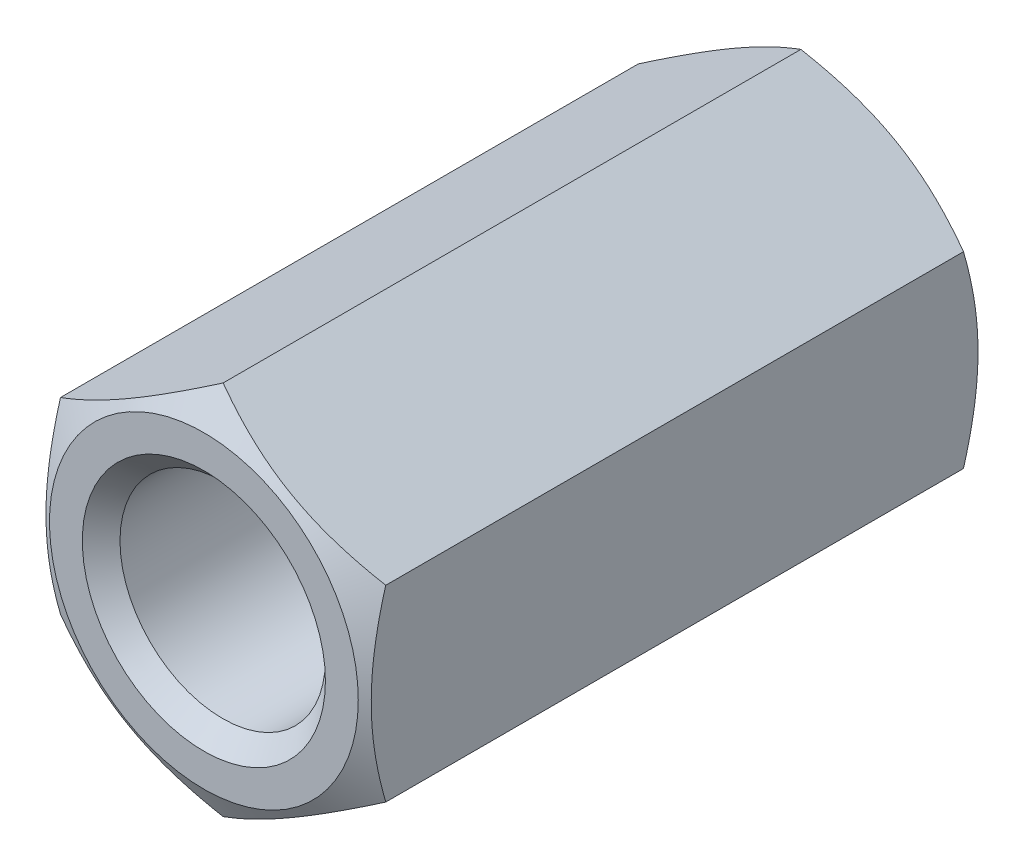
ISO-10303-21;
HEADER;
FILE_DESCRIPTION(('STEP AP214'),'2;1');
FILE_NAME('part.step','',(''),(''),'','','');
FILE_SCHEMA(('AUTOMOTIVE_DESIGN { 1 0 10303 214 1 1 1 1 }'));
ENDSEC;
DATA;
#1=APPLICATION_CONTEXT('core data for automotive mechanical design processes');
#2=APPLICATION_PROTOCOL_DEFINITION('international standard','automotive_design',2000,#1);
#3=PRODUCT_CONTEXT('',#1,'mechanical');
#4=PRODUCT('Part','Part','',(#3));
#5=PRODUCT_RELATED_PRODUCT_CATEGORY('part','',(#4));
#6=PRODUCT_DEFINITION_FORMATION('','',#4);
#7=PRODUCT_DEFINITION_CONTEXT('part definition',#1,'design');
#8=PRODUCT_DEFINITION('design','',#6,#7);
#9=PRODUCT_DEFINITION_SHAPE('','',#8);
#10=(LENGTH_UNIT() NAMED_UNIT(*) SI_UNIT(.MILLI.,.METRE.));
#11=(NAMED_UNIT(*) PLANE_ANGLE_UNIT() SI_UNIT($,.RADIAN.));
#12=(NAMED_UNIT(*) SI_UNIT($,.STERADIAN.) SOLID_ANGLE_UNIT());
#13=UNCERTAINTY_MEASURE_WITH_UNIT(LENGTH_MEASURE(1.E-05),#10,'distance_accuracy_value','');
#14=(GEOMETRIC_REPRESENTATION_CONTEXT(3) GLOBAL_UNCERTAINTY_ASSIGNED_CONTEXT((#13)) GLOBAL_UNIT_ASSIGNED_CONTEXT((#10,
#11,#12)) REPRESENTATION_CONTEXT('',''));
#15=CARTESIAN_POINT('',(0.,0.,0.));
#16=DIRECTION('',(0.,0.,1.));
#17=DIRECTION('',(1.,0.,0.));
#18=AXIS2_PLACEMENT_3D('',#15,#16,#17);
#19=CARTESIAN_POINT('',(9.5,5.48482755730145,36.));
#20=DIRECTION('',(-0.5,-0.866025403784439,0.));
#21=DIRECTION('',(0.866025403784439,-0.5,0.));
#22=AXIS2_PLACEMENT_3D('',#19,#20,#21);
#23=PLANE('',#22);
#24=CARTESIAN_POINT('',(-0.00020000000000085,10.9697705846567,1.12589969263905));
#25=CARTESIAN_POINT('',(0.208630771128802,10.8492020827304,1.05630068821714));
#26=CARTESIAN_POINT('',(0.418240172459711,10.7281840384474,0.989860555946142));
#27=CARTESIAN_POINT('',(0.839139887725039,10.4851774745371,0.864174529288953));
#28=CARTESIAN_POINT('',(1.05043073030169,10.3631886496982,0.804931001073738));
#29=CARTESIAN_POINT('',(1.68770779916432,9.99525656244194,0.639141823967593));
#30=CARTESIAN_POINT('',(2.11620976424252,9.74786083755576,0.544841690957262));
#31=CARTESIAN_POINT('',(2.75744333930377,9.37764446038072,0.434265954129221));
#32=CARTESIAN_POINT('',(2.96825921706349,9.2559298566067,0.402767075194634));
#33=CARTESIAN_POINT('',(3.39086703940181,9.01193711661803,0.349945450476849));
#34=CARTESIAN_POINT('',(3.60265900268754,8.88965896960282,0.328622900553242));
#35=CARTESIAN_POINT('',(4.02659621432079,8.64489870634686,0.296700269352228));
#36=CARTESIAN_POINT('',(4.23874074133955,8.52241700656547,0.286087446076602));
#37=CARTESIAN_POINT('',(4.66322575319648,8.27734047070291,0.275809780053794));
#38=CARTESIAN_POINT('',(4.87556623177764,8.15474563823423,0.276144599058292));
#39=CARTESIAN_POINT('',(5.27254199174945,7.92555157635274,0.287000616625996));
#40=CARTESIAN_POINT('',(5.45720529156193,7.81893617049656,0.296197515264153));
#41=CARTESIAN_POINT('',(5.82610000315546,7.60595470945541,0.322692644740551));
#42=CARTESIAN_POINT('',(6.01033138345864,7.49958867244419,0.33999144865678));
#43=CARTESIAN_POINT('',(6.562311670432,7.18090270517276,0.40363173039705));
#44=CARTESIAN_POINT('',(6.92908353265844,6.96914687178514,0.461709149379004));
#45=CARTESIAN_POINT('',(7.66651782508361,6.54338898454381,0.606903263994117));
#46=CARTESIAN_POINT('',(8.03708614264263,6.32944126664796,0.694635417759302));
#47=CARTESIAN_POINT('',(8.77269671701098,5.90473630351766,0.89375098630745));
#48=CARTESIAN_POINT('',(9.137748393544,5.69397361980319,1.00508763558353));
#49=CARTESIAN_POINT('',(9.5002,5.48471208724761,1.12589969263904));
#50=B_SPLINE_CURVE_WITH_KNOTS('',3,(#24,#25,#26,#27,#28,#29,#30,#31,#32,#33,#34,#35,#36,#37,#38,
#39,#40,#41,#42,#43,#44,#45,#46,#47,#48,#49),.UNSPECIFIED.,.F.,.F.,(4,2,2,2,2,2,2,2,2,2,2,2,4),
(0.,0.752880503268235,1.50600787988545,3.01546870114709,3.75167336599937,4.48789219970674,
5.22323407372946,5.95855322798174,6.5986808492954,7.23885375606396,8.52010929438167,
9.82978009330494,11.1368800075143),.UNSPECIFIED.);
#51=CARTESIAN_POINT('',(0.,10.9696551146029,1.12583302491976));
#52=VERTEX_POINT('',#51);
#53=CARTESIAN_POINT('',(9.5,5.48482755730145,1.12583302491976));
#54=VERTEX_POINT('',#53);
#55=EDGE_CURVE('E30',#52,#54,#50,.T.);
#56=ORIENTED_EDGE('',*,*,#55,.F.);
#57=DIRECTION('',(0.,0.,-1.));
#58=VECTOR('',#57,1.);
#59=CARTESIAN_POINT('',(0.,10.9696551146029,36.));
#60=LINE('',#59,#58);
#61=CARTESIAN_POINT('',(0.,10.9696551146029,34.8741669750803));
#62=VERTEX_POINT('',#61);
#63=EDGE_CURVE('E9',#62,#52,#60,.T.);
#64=ORIENTED_EDGE('',*,*,#63,.F.);
#65=CARTESIAN_POINT('',(9.5002,5.48471208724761,34.874100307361));
#66=CARTESIAN_POINT('',(9.2913692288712,5.6052805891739,34.9436993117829));
#67=CARTESIAN_POINT('',(9.0817598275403,5.72629863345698,35.0101394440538));
#68=CARTESIAN_POINT('',(8.66086011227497,5.96930519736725,35.135825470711));
#69=CARTESIAN_POINT('',(8.44956926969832,6.09129402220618,35.1950689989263));
#70=CARTESIAN_POINT('',(7.81229220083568,6.4592261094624,35.3608581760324));
#71=CARTESIAN_POINT('',(7.38379023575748,6.70662183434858,35.4551583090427));
#72=CARTESIAN_POINT('',(6.74255666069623,7.07683821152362,35.5657340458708));
#73=CARTESIAN_POINT('',(6.53174078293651,7.19855281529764,35.5972329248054));
#74=CARTESIAN_POINT('',(6.10913296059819,7.44254555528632,35.6500545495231));
#75=CARTESIAN_POINT('',(5.89734099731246,7.56482370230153,35.6713770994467));
#76=CARTESIAN_POINT('',(5.47340378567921,7.80958396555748,35.7032997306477));
#77=CARTESIAN_POINT('',(5.26125925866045,7.93206566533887,35.7139125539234));
#78=CARTESIAN_POINT('',(4.83677424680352,8.17714220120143,35.7241902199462));
#79=CARTESIAN_POINT('',(4.62443376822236,8.29973703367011,35.7238554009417));
#80=CARTESIAN_POINT('',(4.22745800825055,8.5289310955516,35.712999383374));
#81=CARTESIAN_POINT('',(4.04279470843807,8.63554650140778,35.7038024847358));
#82=CARTESIAN_POINT('',(3.67389999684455,8.84852796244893,35.6773073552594));
#83=CARTESIAN_POINT('',(3.48966861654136,8.95489399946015,35.6600085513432));
#84=CARTESIAN_POINT('',(2.937688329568,9.27357996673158,35.596368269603));
#85=CARTESIAN_POINT('',(2.57091646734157,9.48533580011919,35.538290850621));
#86=CARTESIAN_POINT('',(1.83348217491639,9.91109368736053,35.3930967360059));
#87=CARTESIAN_POINT('',(1.46291385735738,10.1250414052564,35.3053645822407));
#88=CARTESIAN_POINT('',(0.727303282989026,10.5497463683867,35.1062490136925));
#89=CARTESIAN_POINT('',(0.362251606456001,10.7605090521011,34.9949123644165));
#90=CARTESIAN_POINT('',(-0.000200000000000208,10.9697705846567,34.874100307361));
#91=B_SPLINE_CURVE_WITH_KNOTS('',3,(#65,#66,#67,#68,#69,#70,#71,#72,#73,#74,#75,#76,#77,#78,#79,
#80,#81,#82,#83,#84,#85,#86,#87,#88,#89,#90),.UNSPECIFIED.,.F.,.F.,(4,2,2,2,2,2,2,2,2,2,2,2,4),
(0.,0.752880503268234,1.50600787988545,3.0154687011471,3.75167336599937,4.48789219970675,
5.22323407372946,5.95855322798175,6.5986808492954,7.23885375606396,8.52010929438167,
9.82978009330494,11.1368800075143),.UNSPECIFIED.);
#92=CARTESIAN_POINT('',(9.5,5.48482755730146,34.8741669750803));
#93=VERTEX_POINT('',#92);
#94=EDGE_CURVE('E86',#93,#62,#91,.T.);
#95=ORIENTED_EDGE('',*,*,#94,.F.);
#96=DIRECTION('',(0.,0.,-1.));
#97=VECTOR('',#96,1.);
#98=CARTESIAN_POINT('',(9.5,5.48482755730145,36.));
#99=LINE('',#98,#97);
#100=EDGE_CURVE('E79',#93,#54,#99,.T.);
#101=ORIENTED_EDGE('',*,*,#100,.T.);
#102=EDGE_LOOP('',(#56,#64,#95,#101));
#103=FACE_BOUND('',#102,.T.);
#104=ADVANCED_FACE('F14',(#103),#23,.F.);
#105=CARTESIAN_POINT('',(0.,10.9696551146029,36.));
#106=DIRECTION('',(0.5,-0.866025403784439,0.));
#107=DIRECTION('',(0.866025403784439,0.5,0.));
#108=AXIS2_PLACEMENT_3D('',#105,#106,#107);
#109=PLANE('',#108);
#110=CARTESIAN_POINT('',(-9.5002,5.48471208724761,1.12589969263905));
#111=CARTESIAN_POINT('',(-9.2913692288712,5.6052805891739,1.05630068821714));
#112=CARTESIAN_POINT('',(-9.0817598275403,5.72629863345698,0.989860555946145));
#113=CARTESIAN_POINT('',(-8.66086011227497,5.96930519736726,0.864174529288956));
#114=CARTESIAN_POINT('',(-8.44956926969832,6.09129402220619,0.804931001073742));
#115=CARTESIAN_POINT('',(-7.81229220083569,6.4592261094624,0.639141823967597));
#116=CARTESIAN_POINT('',(-7.38379023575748,6.70662183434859,0.544841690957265));
#117=CARTESIAN_POINT('',(-6.74255666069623,7.07683821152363,0.434265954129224));
#118=CARTESIAN_POINT('',(-6.53174078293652,7.19855281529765,0.402767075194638));
#119=CARTESIAN_POINT('',(-6.10913296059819,7.44254555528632,0.349945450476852));
#120=CARTESIAN_POINT('',(-5.89734099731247,7.56482370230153,0.328622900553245));
#121=CARTESIAN_POINT('',(-5.47340378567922,7.80958396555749,0.296700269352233));
#122=CARTESIAN_POINT('',(-5.26125925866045,7.93206566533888,0.286087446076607));
#123=CARTESIAN_POINT('',(-4.83677424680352,8.17714220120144,0.275809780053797));
#124=CARTESIAN_POINT('',(-4.62443376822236,8.29973703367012,0.276144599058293));
#125=CARTESIAN_POINT('',(-4.22745800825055,8.52893109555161,0.287000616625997));
#126=CARTESIAN_POINT('',(-4.04279470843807,8.63554650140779,0.296197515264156));
#127=CARTESIAN_POINT('',(-3.67389999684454,8.84852796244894,0.322692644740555));
#128=CARTESIAN_POINT('',(-3.48966861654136,8.95489399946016,0.339991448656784));
#129=CARTESIAN_POINT('',(-2.937688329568,9.27357996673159,0.403631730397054));
#130=CARTESIAN_POINT('',(-2.57091646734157,9.4853358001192,0.461709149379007));
#131=CARTESIAN_POINT('',(-1.83348217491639,9.91109368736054,0.606903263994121));
#132=CARTESIAN_POINT('',(-1.46291385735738,10.1250414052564,0.694635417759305));
#133=CARTESIAN_POINT('',(-0.727303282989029,10.5497463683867,0.893750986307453));
#134=CARTESIAN_POINT('',(-0.362251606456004,10.7605090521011,1.00508763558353));
#135=CARTESIAN_POINT('',(0.00019999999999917,10.9697705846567,1.12589969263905));
#136=B_SPLINE_CURVE_WITH_KNOTS('',3,(#110,#111,#112,#113,#114,#115,#116,#117,#118,#119,#120,
#121,#122,#123,#124,#125,#126,#127,#128,#129,#130,#131,#132,#133,#134,#135),.UNSPECIFIED.,.F.,
.F.,(4,2,2,2,2,2,2,2,2,2,2,2,4),(0.,0.752880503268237,1.50600787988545,3.0154687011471,
3.75167336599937,4.48789219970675,5.22323407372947,5.95855322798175,6.59868084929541,
7.23885375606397,8.52010929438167,9.82978009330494,11.1368800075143),.UNSPECIFIED.);
#137=CARTESIAN_POINT('',(-9.5,5.48482755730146,1.12583302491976));
#138=VERTEX_POINT('',#137);
#139=EDGE_CURVE('E66',#138,#52,#136,.T.);
#140=ORIENTED_EDGE('',*,*,#139,.F.);
#141=DIRECTION('',(0.,0.,-1.));
#142=VECTOR('',#141,1.);
#143=CARTESIAN_POINT('',(-9.5,5.48482755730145,36.));
#144=LINE('',#143,#142);
#145=CARTESIAN_POINT('',(-9.5,5.48482755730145,34.8741669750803));
#146=VERTEX_POINT('',#145);
#147=EDGE_CURVE('E23',#146,#138,#144,.T.);
#148=ORIENTED_EDGE('',*,*,#147,.F.);
#149=CARTESIAN_POINT('',(0.000199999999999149,10.9697705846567,34.874100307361));
#150=CARTESIAN_POINT('',(-0.208630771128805,10.8492020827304,34.9436993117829));
#151=CARTESIAN_POINT('',(-0.418240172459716,10.7281840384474,35.0101394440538));
#152=CARTESIAN_POINT('',(-0.839139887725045,10.4851774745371,35.135825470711));
#153=CARTESIAN_POINT('',(-1.05043073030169,10.3631886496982,35.1950689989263));
#154=CARTESIAN_POINT('',(-1.68770779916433,9.99525656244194,35.3608581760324));
#155=CARTESIAN_POINT('',(-2.11620976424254,9.74786083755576,35.4551583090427));
#156=CARTESIAN_POINT('',(-2.75744333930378,9.37764446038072,35.5657340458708));
#157=CARTESIAN_POINT('',(-2.9682592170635,9.2559298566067,35.5972329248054));
#158=CARTESIAN_POINT('',(-3.39086703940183,9.01193711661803,35.6500545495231));
#159=CARTESIAN_POINT('',(-3.60265900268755,8.88965896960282,35.6713770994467));
#160=CARTESIAN_POINT('',(-4.0265962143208,8.64489870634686,35.7032997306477));
#161=CARTESIAN_POINT('',(-4.23874074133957,8.52241700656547,35.7139125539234));
#162=CARTESIAN_POINT('',(-4.66322575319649,8.27734047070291,35.7241902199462));
#163=CARTESIAN_POINT('',(-4.87556623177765,8.15474563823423,35.7238554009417));
#164=CARTESIAN_POINT('',(-5.27254199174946,7.92555157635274,35.712999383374));
#165=CARTESIAN_POINT('',(-5.45720529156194,7.81893617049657,35.7038024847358));
#166=CARTESIAN_POINT('',(-5.82610000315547,7.60595470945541,35.6773073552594));
#167=CARTESIAN_POINT('',(-6.01033138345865,7.4995886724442,35.6600085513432));
#168=CARTESIAN_POINT('',(-6.56231167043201,7.18090270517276,35.5963682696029));
#169=CARTESIAN_POINT('',(-6.92908353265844,6.96914687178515,35.538290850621));
#170=CARTESIAN_POINT('',(-7.66651782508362,6.54338898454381,35.3930967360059));
#171=CARTESIAN_POINT('',(-8.03708614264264,6.32944126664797,35.3053645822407));
#172=CARTESIAN_POINT('',(-8.77269671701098,5.90473630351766,35.1062490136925));
#173=CARTESIAN_POINT('',(-9.137748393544,5.6939736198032,34.9949123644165));
#174=CARTESIAN_POINT('',(-9.5002,5.48471208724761,34.874100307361));
#175=B_SPLINE_CURVE_WITH_KNOTS('',3,(#149,#150,#151,#152,#153,#154,#155,#156,#157,#158,#159,
#160,#161,#162,#163,#164,#165,#166,#167,#168,#169,#170,#171,#172,#173,#174),.UNSPECIFIED.,.F.,
.F.,(4,2,2,2,2,2,2,2,2,2,2,2,4),(0.,0.752880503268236,1.50600787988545,3.0154687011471,
3.75167336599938,4.48789219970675,5.22323407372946,5.95855322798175,6.5986808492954,
7.23885375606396,8.52010929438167,9.82978009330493,11.1368800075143),.UNSPECIFIED.);
#176=EDGE_CURVE('E84',#62,#146,#175,.T.);
#177=ORIENTED_EDGE('',*,*,#176,.F.);
#178=ORIENTED_EDGE('',*,*,#63,.T.);
#179=EDGE_LOOP('',(#140,#148,#177,#178));
#180=FACE_BOUND('',#179,.T.);
#181=ADVANCED_FACE('F83',(#180),#109,.F.);
#182=CARTESIAN_POINT('',(-9.5,5.48482755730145,36.));
#183=DIRECTION('',(1.,0.,0.));
#184=DIRECTION('',(0.,0.,-1.));
#185=AXIS2_PLACEMENT_3D('',#182,#183,#184);
#186=PLANE('',#185);
#187=CARTESIAN_POINT('',(-9.5,-14.5081405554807,4.80476121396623));
#188=CARTESIAN_POINT('',(-9.5,-14.2997453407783,4.70410586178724));
#189=CARTESIAN_POINT('',(-9.5,-14.0910971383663,4.60397454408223));
#190=CARTESIAN_POINT('',(-9.5,-13.6732413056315,4.40488035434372));
#191=CARTESIAN_POINT('',(-9.5,-13.4640336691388,4.3059174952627));
#192=CARTESIAN_POINT('',(-9.5,-12.835429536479,4.01093320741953));
#193=CARTESIAN_POINT('',(-9.5,-12.4151202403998,3.81684921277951));
#194=CARTESIAN_POINT('',(-9.5,-11.5691591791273,3.43398967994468));
#195=CARTESIAN_POINT('',(-9.5,-11.1434905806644,3.2452512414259));
#196=CARTESIAN_POINT('',(-9.5,-10.2886412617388,2.87593346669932));
#197=CARTESIAN_POINT('',(-9.5,-9.8594607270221,2.69535370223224));
#198=CARTESIAN_POINT('',(-9.5,-8.9917551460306,2.34245907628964));
#199=CARTESIAN_POINT('',(-9.5,-8.55317963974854,2.17026759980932));
#200=CARTESIAN_POINT('',(-9.5,-7.67084319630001,1.83946652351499));
#201=CARTESIAN_POINT('',(-9.5,-7.2270816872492,1.68085843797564));
#202=CARTESIAN_POINT('',(-9.5,-6.33458604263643,1.38151495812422));
#203=CARTESIAN_POINT('',(-9.5,-5.885864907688,1.24074122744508));
#204=CARTESIAN_POINT('',(-9.5,-4.98206148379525,0.981660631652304));
#205=CARTESIAN_POINT('',(-9.5,-4.52698126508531,0.863346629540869));
#206=CARTESIAN_POINT('',(-9.5,-3.61005735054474,0.65495905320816));
#207=CARTESIAN_POINT('',(-9.5,-3.14821142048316,0.56489503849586));
#208=CARTESIAN_POINT('',(-9.5,-2.45141173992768,0.45551817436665));
#209=CARTESIAN_POINT('',(-9.5,-2.21844485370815,0.423343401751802));
#210=CARTESIAN_POINT('',(-9.5,-1.75143138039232,0.368200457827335));
#211=CARTESIAN_POINT('',(-9.5,-1.51738489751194,0.34523141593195));
#212=CARTESIAN_POINT('',(-9.5,-1.04999217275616,0.309116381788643));
#213=CARTESIAN_POINT('',(-9.5,-0.816650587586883,0.295910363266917));
#214=CARTESIAN_POINT('',(-9.5,-0.349618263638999,0.279390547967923));
#215=CARTESIAN_POINT('',(-9.5,-0.11592753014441,0.276076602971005));
#216=CARTESIAN_POINT('',(-9.5,0.351318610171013,0.279419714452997));
#217=CARTESIAN_POINT('',(-9.5,0.584874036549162,0.286074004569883));
#218=CARTESIAN_POINT('',(-9.5,1.05150236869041,0.309189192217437));
#219=CARTESIAN_POINT('',(-9.5,1.2845752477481,0.325650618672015));
#220=CARTESIAN_POINT('',(-9.5,1.85053935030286,0.377189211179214));
#221=CARTESIAN_POINT('',(-9.5,2.1829864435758,0.417239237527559));
#222=CARTESIAN_POINT('',(-9.5,2.84525035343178,0.515052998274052));
#223=CARTESIAN_POINT('',(-9.5,3.17506676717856,0.572819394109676));
#224=CARTESIAN_POINT('',(-9.5,4.16115816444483,0.769792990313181));
#225=CARTESIAN_POINT('',(-9.5,4.81278369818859,0.932542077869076));
#226=CARTESIAN_POINT('',(-9.5,5.78743116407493,1.21284541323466));
#227=CARTESIAN_POINT('',(-9.5,6.11555354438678,1.31366841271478));
#228=CARTESIAN_POINT('',(-9.5,6.76862851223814,1.52528820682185));
#229=CARTESIAN_POINT('',(-9.5,7.09358081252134,1.63608589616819));
#230=CARTESIAN_POINT('',(-9.5,7.7386929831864,1.86528688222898));
#231=CARTESIAN_POINT('',(-9.5,8.05886956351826,1.98364362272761));
#232=CARTESIAN_POINT('',(-9.5,8.69650333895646,2.22716081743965));
#233=CARTESIAN_POINT('',(-9.5,9.01396143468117,2.35231890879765));
#234=CARTESIAN_POINT('',(-9.5,9.33027579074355,2.48023985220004));
#235=B_SPLINE_CURVE_WITH_KNOTS('',3,(#187,#188,#189,#190,#191,#192,#193,#194,#195,#196,#197,
#198,#199,#200,#201,#202,#203,#204,#205,#206,#207,#208,#209,#210,#211,#212,#213,#214,#215,#216,
#217,#218,#219,#220,#221,#222,#223,#224,#225,#226,#227,#228,#229,#230,#231,#232,#233,#234),
.UNSPECIFIED.,.F.,.F.,(4,2,2,2,2,2,2,2,2,2,2,2,2,2,2,2,2,2,2,2,2,2,2,4),(0.,0.694290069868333,
1.38858782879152,2.77741141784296,4.17425003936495,5.5710152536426,6.98434198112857,
8.397826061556,9.80821824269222,11.2181614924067,12.6285813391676,13.333962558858,
14.0392770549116,14.7402181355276,15.4411487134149,16.1418848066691,16.8426586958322,
17.8466399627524,18.8507721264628,20.8629143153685,21.8926247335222,22.9224276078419,
23.9464065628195,24.9700320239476),.UNSPECIFIED.);
#236=CARTESIAN_POINT('',(-9.5,-5.48482755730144,1.12583302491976));
#237=VERTEX_POINT('',#236);
#238=EDGE_CURVE('E69',#237,#138,#235,.T.);
#239=ORIENTED_EDGE('',*,*,#238,.F.);
#240=DIRECTION('',(0.,0.,-1.));
#241=VECTOR('',#240,1.);
#242=CARTESIAN_POINT('',(-9.5,-5.48482755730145,36.));
#243=LINE('',#242,#241);
#244=CARTESIAN_POINT('',(-9.5,-5.48482755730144,34.8741669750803));
#245=VERTEX_POINT('',#244);
#246=EDGE_CURVE('E192',#245,#237,#243,.T.);
#247=ORIENTED_EDGE('',*,*,#246,.F.);
#248=CARTESIAN_POINT('',(-9.5,-14.5081405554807,31.1952387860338));
#249=CARTESIAN_POINT('',(-9.5,-14.2997453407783,31.2958941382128));
#250=CARTESIAN_POINT('',(-9.5,-14.0910971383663,31.3960254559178));
#251=CARTESIAN_POINT('',(-9.5,-13.6732413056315,31.5951196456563));
#252=CARTESIAN_POINT('',(-9.5,-13.4640336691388,31.6940825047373));
#253=CARTESIAN_POINT('',(-9.5,-12.835429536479,31.9890667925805));
#254=CARTESIAN_POINT('',(-9.5,-12.4151202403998,32.1831507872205));
#255=CARTESIAN_POINT('',(-9.5,-11.5691591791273,32.5660103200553));
#256=CARTESIAN_POINT('',(-9.5,-11.1434905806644,32.7547487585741));
#257=CARTESIAN_POINT('',(-9.5,-10.2886412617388,33.1240665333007));
#258=CARTESIAN_POINT('',(-9.5,-9.8594607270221,33.3046462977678));
#259=CARTESIAN_POINT('',(-9.5,-8.9917551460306,33.6575409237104));
#260=CARTESIAN_POINT('',(-9.5,-8.55317963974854,33.8297324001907));
#261=CARTESIAN_POINT('',(-9.5,-7.67084319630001,34.160533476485));
#262=CARTESIAN_POINT('',(-9.5,-7.2270816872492,34.3191415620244));
#263=CARTESIAN_POINT('',(-9.5,-6.33458604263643,34.6184850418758));
#264=CARTESIAN_POINT('',(-9.5,-5.88586490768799,34.7592587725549));
#265=CARTESIAN_POINT('',(-9.5,-4.98206148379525,35.0183393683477));
#266=CARTESIAN_POINT('',(-9.5,-4.5269812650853,35.1366533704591));
#267=CARTESIAN_POINT('',(-9.5,-3.61005735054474,35.3450409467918));
#268=CARTESIAN_POINT('',(-9.5,-3.14821142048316,35.4351049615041));
#269=CARTESIAN_POINT('',(-9.5,-2.45141173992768,35.5444818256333));
#270=CARTESIAN_POINT('',(-9.5,-2.21844485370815,35.5766565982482));
#271=CARTESIAN_POINT('',(-9.5,-1.75143138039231,35.6317995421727));
#272=CARTESIAN_POINT('',(-9.5,-1.51738489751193,35.654768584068));
#273=CARTESIAN_POINT('',(-9.5,-1.04999217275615,35.6908836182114));
#274=CARTESIAN_POINT('',(-9.5,-0.816650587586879,35.7040896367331));
#275=CARTESIAN_POINT('',(-9.5,-0.349618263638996,35.7206094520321));
#276=CARTESIAN_POINT('',(-9.5,-0.115927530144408,35.723923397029));
#277=CARTESIAN_POINT('',(-9.5,0.351318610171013,35.720580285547));
#278=CARTESIAN_POINT('',(-9.5,0.584874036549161,35.7139259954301));
#279=CARTESIAN_POINT('',(-9.5,1.0515023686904,35.6908108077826));
#280=CARTESIAN_POINT('',(-9.5,1.2845752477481,35.674349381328));
#281=CARTESIAN_POINT('',(-9.5,1.85053935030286,35.6228107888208));
#282=CARTESIAN_POINT('',(-9.5,2.18298644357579,35.5827607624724));
#283=CARTESIAN_POINT('',(-9.5,2.84525035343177,35.4849470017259));
#284=CARTESIAN_POINT('',(-9.5,3.17506676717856,35.4271806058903));
#285=CARTESIAN_POINT('',(-9.5,4.16115816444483,35.2302070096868));
#286=CARTESIAN_POINT('',(-9.5,4.8127836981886,35.0674579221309));
#287=CARTESIAN_POINT('',(-9.5,5.78743116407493,34.7871545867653));
#288=CARTESIAN_POINT('',(-9.5,6.11555354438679,34.6863315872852));
#289=CARTESIAN_POINT('',(-9.5,6.76862851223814,34.4747117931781));
#290=CARTESIAN_POINT('',(-9.5,7.09358081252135,34.3639141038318));
#291=CARTESIAN_POINT('',(-9.5,7.73869298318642,34.134713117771));
#292=CARTESIAN_POINT('',(-9.5,8.05886956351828,34.0163563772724));
#293=CARTESIAN_POINT('',(-9.5,8.69650333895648,33.7728391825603));
#294=CARTESIAN_POINT('',(-9.5,9.01396143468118,33.6476810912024));
#295=CARTESIAN_POINT('',(-9.5,9.33027579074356,33.5197601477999));
#296=B_SPLINE_CURVE_WITH_KNOTS('',3,(#248,#249,#250,#251,#252,#253,#254,#255,#256,#257,#258,
#259,#260,#261,#262,#263,#264,#265,#266,#267,#268,#269,#270,#271,#272,#273,#274,#275,#276,#277,
#278,#279,#280,#281,#282,#283,#284,#285,#286,#287,#288,#289,#290,#291,#292,#293,#294,#295),
.UNSPECIFIED.,.F.,.F.,(4,2,2,2,2,2,2,2,2,2,2,2,2,2,2,2,2,2,2,2,2,2,2,4),(0.,0.694290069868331,
1.38858782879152,2.77741141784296,4.17425003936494,5.57101525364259,6.98434198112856,
8.39782606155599,9.80821824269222,11.2181614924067,12.6285813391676,13.333962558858,
14.0392770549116,14.7402181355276,15.4411487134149,16.1418848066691,16.8426586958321,
17.8466399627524,18.8507721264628,20.8629143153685,21.8926247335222,22.9224276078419,
23.9464065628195,24.9700320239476),.UNSPECIFIED.);
#297=EDGE_CURVE('E87',#146,#245,#296,.F.);
#298=ORIENTED_EDGE('',*,*,#297,.F.);
#299=ORIENTED_EDGE('',*,*,#147,.T.);
#300=EDGE_LOOP('',(#239,#247,#298,#299));
#301=FACE_BOUND('',#300,.T.);
#302=ADVANCED_FACE('F148',(#301),#186,.F.);
#303=CARTESIAN_POINT('',(-9.5,-5.48482755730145,36.));
#304=DIRECTION('',(0.5,0.866025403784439,0.));
#305=DIRECTION('',(-0.866025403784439,0.5,0.));
#306=AXIS2_PLACEMENT_3D('',#303,#304,#305);
#307=PLANE('',#306);
#308=CARTESIAN_POINT('',(0.000199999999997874,-10.9697705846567,1.12589969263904));
#309=CARTESIAN_POINT('',(-0.208630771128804,-10.8492020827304,1.05630068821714));
#310=CARTESIAN_POINT('',(-0.418240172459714,-10.7281840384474,0.989860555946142));
#311=CARTESIAN_POINT('',(-0.839139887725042,-10.4851774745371,0.864174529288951));
#312=CARTESIAN_POINT('',(-1.05043073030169,-10.3631886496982,0.804931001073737));
#313=CARTESIAN_POINT('',(-1.68770779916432,-9.99525656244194,0.639141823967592));
#314=CARTESIAN_POINT('',(-2.11620976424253,-9.74786083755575,0.544841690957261));
#315=CARTESIAN_POINT('',(-2.75744333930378,-9.37764446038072,0.43426595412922));
#316=CARTESIAN_POINT('',(-2.96825921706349,-9.2559298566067,0.402767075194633));
#317=CARTESIAN_POINT('',(-3.39086703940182,-9.01193711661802,0.349945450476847));
#318=CARTESIAN_POINT('',(-3.60265900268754,-8.88965896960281,0.328622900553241));
#319=CARTESIAN_POINT('',(-4.02659621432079,-8.64489870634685,0.296700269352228));
#320=CARTESIAN_POINT('',(-4.23874074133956,-8.52241700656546,0.286087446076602));
#321=CARTESIAN_POINT('',(-4.66322575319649,-8.27734047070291,0.275809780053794));
#322=CARTESIAN_POINT('',(-4.87556623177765,-8.15474563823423,0.276144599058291));
#323=CARTESIAN_POINT('',(-5.27254199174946,-7.92555157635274,0.287000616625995));
#324=CARTESIAN_POINT('',(-5.45720529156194,-7.81893617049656,0.296197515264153));
#325=CARTESIAN_POINT('',(-5.82610000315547,-7.60595470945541,0.322692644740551));
#326=CARTESIAN_POINT('',(-6.01033138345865,-7.49958867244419,0.33999144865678));
#327=CARTESIAN_POINT('',(-6.56231167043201,-7.18090270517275,0.403631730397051));
#328=CARTESIAN_POINT('',(-6.92908353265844,-6.96914687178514,0.461709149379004));
#329=CARTESIAN_POINT('',(-7.66651782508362,-6.5433889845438,0.606903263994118));
#330=CARTESIAN_POINT('',(-8.03708614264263,-6.32944126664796,0.694635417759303));
#331=CARTESIAN_POINT('',(-8.77269671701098,-5.90473630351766,0.893750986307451));
#332=CARTESIAN_POINT('',(-9.137748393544,-5.69397361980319,1.00508763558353));
#333=CARTESIAN_POINT('',(-9.5002,-5.48471208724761,1.12589969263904));
#334=B_SPLINE_CURVE_WITH_KNOTS('',3,(#308,#309,#310,#311,#312,#313,#314,#315,#316,#317,#318,
#319,#320,#321,#322,#323,#324,#325,#326,#327,#328,#329,#330,#331,#332,#333),.UNSPECIFIED.,.F.,
.F.,(4,2,2,2,2,2,2,2,2,2,2,2,4),(0.,0.752880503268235,1.50600787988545,3.0154687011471,
3.75167336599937,4.48789219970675,5.22323407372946,5.95855322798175,6.59868084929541,
7.23885375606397,8.52010929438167,9.82978009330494,11.1368800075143),.UNSPECIFIED.);
#335=CARTESIAN_POINT('',(0.,-10.9696551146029,1.12583302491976));
#336=VERTEX_POINT('',#335);
#337=EDGE_CURVE('E154',#336,#237,#334,.T.);
#338=ORIENTED_EDGE('',*,*,#337,.F.);
#339=DIRECTION('',(0.,0.,-1.));
#340=VECTOR('',#339,1.);
#341=CARTESIAN_POINT('',(0.,-10.9696551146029,36.));
#342=LINE('',#341,#340);
#343=CARTESIAN_POINT('',(0.,-10.9696551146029,34.8741669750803));
#344=VERTEX_POINT('',#343);
#345=EDGE_CURVE('E187',#344,#336,#342,.T.);
#346=ORIENTED_EDGE('',*,*,#345,.F.);
#347=CARTESIAN_POINT('',(-9.5002,-5.48471208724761,34.874100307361));
#348=CARTESIAN_POINT('',(-9.2913692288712,-5.6052805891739,34.9436993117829));
#349=CARTESIAN_POINT('',(-9.08175982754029,-5.72629863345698,35.0101394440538));
#350=CARTESIAN_POINT('',(-8.66086011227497,-5.96930519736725,35.135825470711));
#351=CARTESIAN_POINT('',(-8.44956926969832,-6.09129402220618,35.1950689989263));
#352=CARTESIAN_POINT('',(-7.81229220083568,-6.4592261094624,35.3608581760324));
#353=CARTESIAN_POINT('',(-7.38379023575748,-6.70662183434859,35.4551583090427));
#354=CARTESIAN_POINT('',(-6.74255666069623,-7.07683821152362,35.5657340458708));
#355=CARTESIAN_POINT('',(-6.53174078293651,-7.19855281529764,35.5972329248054));
#356=CARTESIAN_POINT('',(-6.10913296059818,-7.44254555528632,35.6500545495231));
#357=CARTESIAN_POINT('',(-5.89734099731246,-7.56482370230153,35.6713770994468));
#358=CARTESIAN_POINT('',(-5.47340378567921,-7.80958396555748,35.7032997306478));
#359=CARTESIAN_POINT('',(-5.26125925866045,-7.93206566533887,35.7139125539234));
#360=CARTESIAN_POINT('',(-4.83677424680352,-8.17714220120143,35.7241902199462));
#361=CARTESIAN_POINT('',(-4.62443376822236,-8.29973703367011,35.7238554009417));
#362=CARTESIAN_POINT('',(-4.22745800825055,-8.5289310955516,35.712999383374));
#363=CARTESIAN_POINT('',(-4.04279470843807,-8.63554650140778,35.7038024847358));
#364=CARTESIAN_POINT('',(-3.67389999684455,-8.84852796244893,35.6773073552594));
#365=CARTESIAN_POINT('',(-3.48966861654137,-8.95489399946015,35.6600085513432));
#366=CARTESIAN_POINT('',(-2.93768832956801,-9.27357996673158,35.596368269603));
#367=CARTESIAN_POINT('',(-2.57091646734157,-9.48533580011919,35.538290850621));
#368=CARTESIAN_POINT('',(-1.83348217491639,-9.91109368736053,35.3930967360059));
#369=CARTESIAN_POINT('',(-1.46291385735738,-10.1250414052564,35.3053645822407));
#370=CARTESIAN_POINT('',(-0.727303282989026,-10.5497463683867,35.1062490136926));
#371=CARTESIAN_POINT('',(-0.362251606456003,-10.7605090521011,34.9949123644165));
#372=CARTESIAN_POINT('',(0.000199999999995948,-10.9697705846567,34.874100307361));
#373=B_SPLINE_CURVE_WITH_KNOTS('',3,(#347,#348,#349,#350,#351,#352,#353,#354,#355,#356,#357,
#358,#359,#360,#361,#362,#363,#364,#365,#366,#367,#368,#369,#370,#371,#372),.UNSPECIFIED.,.F.,
.F.,(4,2,2,2,2,2,2,2,2,2,2,2,4),(0.,0.752880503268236,1.50600787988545,3.0154687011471,
3.75167336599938,4.48789219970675,5.22323407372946,5.95855322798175,6.5986808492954,
7.23885375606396,8.52010929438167,9.82978009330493,11.1368800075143),.UNSPECIFIED.);
#374=EDGE_CURVE('E90',#245,#344,#373,.T.);
#375=ORIENTED_EDGE('',*,*,#374,.F.);
#376=ORIENTED_EDGE('',*,*,#246,.T.);
#377=EDGE_LOOP('',(#338,#346,#375,#376));
#378=FACE_BOUND('',#377,.T.);
#379=ADVANCED_FACE('F144',(#378),#307,.F.);
#380=CARTESIAN_POINT('',(0.,-10.9696551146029,36.));
#381=DIRECTION('',(-0.5,0.866025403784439,0.));
#382=DIRECTION('',(-0.866025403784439,-0.5,0.));
#383=AXIS2_PLACEMENT_3D('',#380,#381,#382);
#384=PLANE('',#383);
#385=CARTESIAN_POINT('',(9.5002,-5.48471208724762,1.12589969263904));
#386=CARTESIAN_POINT('',(9.2913692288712,-5.60528058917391,1.05630068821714));
#387=CARTESIAN_POINT('',(9.08175982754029,-5.72629863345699,0.989860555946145));
#388=CARTESIAN_POINT('',(8.66086011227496,-5.96930519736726,0.864174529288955));
#389=CARTESIAN_POINT('',(8.44956926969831,-6.09129402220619,0.80493100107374));
#390=CARTESIAN_POINT('',(7.81229220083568,-6.45922610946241,0.639141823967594));
#391=CARTESIAN_POINT('',(7.38379023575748,-6.70662183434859,0.544841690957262));
#392=CARTESIAN_POINT('',(6.74255666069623,-7.07683821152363,0.434265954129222));
#393=CARTESIAN_POINT('',(6.53174078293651,-7.19855281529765,0.402767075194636));
#394=CARTESIAN_POINT('',(6.10913296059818,-7.44254555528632,0.349945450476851));
#395=CARTESIAN_POINT('',(5.89734099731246,-7.56482370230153,0.328622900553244));
#396=CARTESIAN_POINT('',(5.47340378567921,-7.80958396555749,0.296700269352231));
#397=CARTESIAN_POINT('',(5.26125925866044,-7.93206566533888,0.286087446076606));
#398=CARTESIAN_POINT('',(4.83677424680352,-8.17714220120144,0.275809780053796));
#399=CARTESIAN_POINT('',(4.62443376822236,-8.29973703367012,0.276144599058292));
#400=CARTESIAN_POINT('',(4.22745800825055,-8.52893109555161,0.287000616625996));
#401=CARTESIAN_POINT('',(4.04279470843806,-8.63554650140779,0.296197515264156));
#402=CARTESIAN_POINT('',(3.67389999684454,-8.84852796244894,0.322692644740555));
#403=CARTESIAN_POINT('',(3.48966861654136,-8.95489399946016,0.339991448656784));
#404=CARTESIAN_POINT('',(2.937688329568,-9.27357996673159,0.403631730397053));
#405=CARTESIAN_POINT('',(2.57091646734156,-9.4853358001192,0.461709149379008));
#406=CARTESIAN_POINT('',(1.83348217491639,-9.91109368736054,0.606903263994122));
#407=CARTESIAN_POINT('',(1.46291385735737,-10.1250414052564,0.694635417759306));
#408=CARTESIAN_POINT('',(0.727303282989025,-10.5497463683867,0.893750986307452));
#409=CARTESIAN_POINT('',(0.362251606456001,-10.7605090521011,1.00508763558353));
#410=CARTESIAN_POINT('',(-0.000200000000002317,-10.9697705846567,1.12589969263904));
#411=B_SPLINE_CURVE_WITH_KNOTS('',3,(#385,#386,#387,#388,#389,#390,#391,#392,#393,#394,#395,
#396,#397,#398,#399,#400,#401,#402,#403,#404,#405,#406,#407,#408,#409,#410),.UNSPECIFIED.,.F.,
.F.,(4,2,2,2,2,2,2,2,2,2,2,2,4),(0.,0.752880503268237,1.50600787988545,3.0154687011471,
3.75167336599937,4.48789219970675,5.22323407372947,5.95855322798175,6.59868084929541,
7.23885375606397,8.52010929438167,9.82978009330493,11.1368800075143),.UNSPECIFIED.);
#412=CARTESIAN_POINT('',(9.5,-5.48482755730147,1.12583302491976));
#413=VERTEX_POINT('',#412);
#414=EDGE_CURVE('E161',#413,#336,#411,.T.);
#415=ORIENTED_EDGE('',*,*,#414,.F.);
#416=DIRECTION('',(0.,0.,-1.));
#417=VECTOR('',#416,1.);
#418=CARTESIAN_POINT('',(9.5,-5.48482755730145,36.));
#419=LINE('',#418,#417);
#420=CARTESIAN_POINT('',(9.5,-5.48482755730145,34.8741669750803));
#421=VERTEX_POINT('',#420);
#422=EDGE_CURVE('E186',#421,#413,#419,.T.);
#423=ORIENTED_EDGE('',*,*,#422,.F.);
#424=CARTESIAN_POINT('',(-0.000200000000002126,-10.9697705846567,34.874100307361));
#425=CARTESIAN_POINT('',(0.208630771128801,-10.8492020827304,34.9436993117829));
#426=CARTESIAN_POINT('',(0.418240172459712,-10.7281840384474,35.0101394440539));
#427=CARTESIAN_POINT('',(0.83913988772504,-10.4851774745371,35.135825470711));
#428=CARTESIAN_POINT('',(1.05043073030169,-10.3631886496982,35.1950689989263));
#429=CARTESIAN_POINT('',(1.68770779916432,-9.99525656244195,35.3608581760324));
#430=CARTESIAN_POINT('',(2.11620976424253,-9.74786083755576,35.4551583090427));
#431=CARTESIAN_POINT('',(2.75744333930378,-9.37764446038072,35.5657340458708));
#432=CARTESIAN_POINT('',(2.96825921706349,-9.2559298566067,35.5972329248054));
#433=CARTESIAN_POINT('',(3.39086703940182,-9.01193711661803,35.6500545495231));
#434=CARTESIAN_POINT('',(3.60265900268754,-8.88965896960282,35.6713770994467));
#435=CARTESIAN_POINT('',(4.02659621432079,-8.64489870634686,35.7032997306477));
#436=CARTESIAN_POINT('',(4.23874074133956,-8.52241700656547,35.7139125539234));
#437=CARTESIAN_POINT('',(4.66322575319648,-8.27734047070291,35.7241902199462));
#438=CARTESIAN_POINT('',(4.87556623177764,-8.15474563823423,35.7238554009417));
#439=CARTESIAN_POINT('',(5.27254199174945,-7.92555157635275,35.712999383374));
#440=CARTESIAN_POINT('',(5.45720529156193,-7.81893617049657,35.7038024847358));
#441=CARTESIAN_POINT('',(5.82610000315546,-7.60595470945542,35.6773073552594));
#442=CARTESIAN_POINT('',(6.01033138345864,-7.4995886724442,35.6600085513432));
#443=CARTESIAN_POINT('',(6.562311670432,-7.18090270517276,35.5963682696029));
#444=CARTESIAN_POINT('',(6.92908353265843,-6.96914687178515,35.538290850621));
#445=CARTESIAN_POINT('',(7.66651782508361,-6.54338898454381,35.3930967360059));
#446=CARTESIAN_POINT('',(8.03708614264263,-6.32944126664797,35.3053645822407));
#447=CARTESIAN_POINT('',(8.77269671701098,-5.90473630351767,35.1062490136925));
#448=CARTESIAN_POINT('',(9.137748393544,-5.6939736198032,34.9949123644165));
#449=CARTESIAN_POINT('',(9.5002,-5.48471208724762,34.874100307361));
#450=B_SPLINE_CURVE_WITH_KNOTS('',3,(#424,#425,#426,#427,#428,#429,#430,#431,#432,#433,#434,
#435,#436,#437,#438,#439,#440,#441,#442,#443,#444,#445,#446,#447,#448,#449),.UNSPECIFIED.,.F.,
.F.,(4,2,2,2,2,2,2,2,2,2,2,2,4),(0.,0.752880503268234,1.50600787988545,3.0154687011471,
3.75167336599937,4.48789219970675,5.22323407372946,5.95855322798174,6.5986808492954,
7.23885375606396,8.52010929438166,9.82978009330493,11.1368800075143),.UNSPECIFIED.);
#451=EDGE_CURVE('E38',#344,#421,#450,.T.);
#452=ORIENTED_EDGE('',*,*,#451,.F.);
#453=ORIENTED_EDGE('',*,*,#345,.T.);
#454=EDGE_LOOP('',(#415,#423,#452,#453));
#455=FACE_BOUND('',#454,.T.);
#456=ADVANCED_FACE('F147',(#455),#384,.F.);
#457=CARTESIAN_POINT('',(9.5,-5.48482755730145,36.));
#458=DIRECTION('',(-1.,0.,0.));
#459=DIRECTION('',(0.,0.,1.));
#460=AXIS2_PLACEMENT_3D('',#457,#458,#459);
#461=PLANE('',#460);
#462=CARTESIAN_POINT('',(9.5,-14.5081405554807,4.80476121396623));
#463=CARTESIAN_POINT('',(9.5,-14.2997453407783,4.70410586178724));
#464=CARTESIAN_POINT('',(9.5,-14.0910971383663,4.60397454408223));
#465=CARTESIAN_POINT('',(9.5,-13.6732413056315,4.40488035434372));
#466=CARTESIAN_POINT('',(9.5,-13.4640336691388,4.3059174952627));
#467=CARTESIAN_POINT('',(9.5,-12.835429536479,4.01093320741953));
#468=CARTESIAN_POINT('',(9.5,-12.4151202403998,3.81684921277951));
#469=CARTESIAN_POINT('',(9.5,-11.5691591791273,3.43398967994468));
#470=CARTESIAN_POINT('',(9.5,-11.1434905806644,3.2452512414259));
#471=CARTESIAN_POINT('',(9.5,-10.2886412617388,2.87593346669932));
#472=CARTESIAN_POINT('',(9.5,-9.8594607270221,2.69535370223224));
#473=CARTESIAN_POINT('',(9.5,-8.9917551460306,2.34245907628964));
#474=CARTESIAN_POINT('',(9.5,-8.55317963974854,2.17026759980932));
#475=CARTESIAN_POINT('',(9.5,-7.67084319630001,1.83946652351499));
#476=CARTESIAN_POINT('',(9.5,-7.2270816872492,1.68085843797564));
#477=CARTESIAN_POINT('',(9.5,-6.33458604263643,1.38151495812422));
#478=CARTESIAN_POINT('',(9.5,-5.885864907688,1.24074122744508));
#479=CARTESIAN_POINT('',(9.5,-4.98206148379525,0.981660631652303));
#480=CARTESIAN_POINT('',(9.5,-4.52698126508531,0.863346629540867));
#481=CARTESIAN_POINT('',(9.5,-3.61005735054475,0.654959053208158));
#482=CARTESIAN_POINT('',(9.5,-3.14821142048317,0.564895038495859));
#483=CARTESIAN_POINT('',(9.5,-2.45141173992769,0.455518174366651));
#484=CARTESIAN_POINT('',(9.5,-2.21844485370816,0.423343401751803));
#485=CARTESIAN_POINT('',(9.5,-1.75143138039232,0.368200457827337));
#486=CARTESIAN_POINT('',(9.5,-1.51738489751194,0.345231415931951));
#487=CARTESIAN_POINT('',(9.5,-1.04999217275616,0.309116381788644));
#488=CARTESIAN_POINT('',(9.5,-0.81665058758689,0.295910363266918));
#489=CARTESIAN_POINT('',(9.5,-0.349618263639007,0.279390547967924));
#490=CARTESIAN_POINT('',(9.5,-0.115927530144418,0.276076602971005));
#491=CARTESIAN_POINT('',(9.5,0.351318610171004,0.279419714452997));
#492=CARTESIAN_POINT('',(9.5,0.584874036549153,0.286074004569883));
#493=CARTESIAN_POINT('',(9.5,1.0515023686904,0.309189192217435));
#494=CARTESIAN_POINT('',(9.5,1.28457524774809,0.325650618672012));
#495=CARTESIAN_POINT('',(9.5,1.85053935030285,0.37718921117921));
#496=CARTESIAN_POINT('',(9.5,2.18298644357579,0.417239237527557));
#497=CARTESIAN_POINT('',(9.5,2.84525035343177,0.515052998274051));
#498=CARTESIAN_POINT('',(9.5,3.17506676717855,0.572819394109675));
#499=CARTESIAN_POINT('',(9.5,4.16115816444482,0.769792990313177));
#500=CARTESIAN_POINT('',(9.5,4.81278369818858,0.932542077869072));
#501=CARTESIAN_POINT('',(9.5,5.78743116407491,1.21284541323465));
#502=CARTESIAN_POINT('',(9.5,6.11555354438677,1.31366841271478));
#503=CARTESIAN_POINT('',(9.5,6.76862851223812,1.52528820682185));
#504=CARTESIAN_POINT('',(9.5,7.09358081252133,1.63608589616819));
#505=CARTESIAN_POINT('',(9.5,7.73869298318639,1.86528688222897));
#506=CARTESIAN_POINT('',(9.5,8.05886956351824,1.9836436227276));
#507=CARTESIAN_POINT('',(9.5,8.69650333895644,2.22716081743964));
#508=CARTESIAN_POINT('',(9.5,9.01396143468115,2.35231890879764));
#509=CARTESIAN_POINT('',(9.5,9.33027579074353,2.48023985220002));
#510=B_SPLINE_CURVE_WITH_KNOTS('',3,(#462,#463,#464,#465,#466,#467,#468,#469,#470,#471,#472,
#473,#474,#475,#476,#477,#478,#479,#480,#481,#482,#483,#484,#485,#486,#487,#488,#489,#490,#491,
#492,#493,#494,#495,#496,#497,#498,#499,#500,#501,#502,#503,#504,#505,#506,#507,#508,#509),
.UNSPECIFIED.,.F.,.F.,(4,2,2,2,2,2,2,2,2,2,2,2,2,2,2,2,2,2,2,2,2,2,2,4),(0.,0.694290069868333,
1.38858782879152,2.77741141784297,4.17425003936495,5.5710152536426,6.98434198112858,
8.397826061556,9.80821824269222,11.2181614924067,12.6285813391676,13.333962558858,
14.0392770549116,14.7402181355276,15.4411487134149,16.1418848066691,16.8426586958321,
17.8466399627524,18.8507721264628,20.8629143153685,21.8926247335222,22.9224276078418,
23.9464065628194,24.9700320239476),.UNSPECIFIED.);
#511=EDGE_CURVE('E185',#54,#413,#510,.F.);
#512=ORIENTED_EDGE('',*,*,#511,.F.);
#513=ORIENTED_EDGE('',*,*,#100,.F.);
#514=CARTESIAN_POINT('',(9.5,-14.5081405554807,31.1952387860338));
#515=CARTESIAN_POINT('',(9.5,-14.2997453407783,31.2958941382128));
#516=CARTESIAN_POINT('',(9.5,-14.0910971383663,31.3960254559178));
#517=CARTESIAN_POINT('',(9.5,-13.6732413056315,31.5951196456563));
#518=CARTESIAN_POINT('',(9.5,-13.4640336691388,31.6940825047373));
#519=CARTESIAN_POINT('',(9.5,-12.835429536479,31.9890667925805));
#520=CARTESIAN_POINT('',(9.5,-12.4151202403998,32.1831507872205));
#521=CARTESIAN_POINT('',(9.5,-11.5691591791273,32.5660103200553));
#522=CARTESIAN_POINT('',(9.5,-11.1434905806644,32.7547487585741));
#523=CARTESIAN_POINT('',(9.5,-10.2886412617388,33.1240665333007));
#524=CARTESIAN_POINT('',(9.5,-9.8594607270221,33.3046462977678));
#525=CARTESIAN_POINT('',(9.5,-8.9917551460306,33.6575409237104));
#526=CARTESIAN_POINT('',(9.5,-8.55317963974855,33.8297324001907));
#527=CARTESIAN_POINT('',(9.5,-7.67084319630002,34.160533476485));
#528=CARTESIAN_POINT('',(9.5,-7.2270816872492,34.3191415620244));
#529=CARTESIAN_POINT('',(9.5,-6.33458604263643,34.6184850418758));
#530=CARTESIAN_POINT('',(9.5,-5.885864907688,34.7592587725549));
#531=CARTESIAN_POINT('',(9.5,-4.98206148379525,35.0183393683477));
#532=CARTESIAN_POINT('',(9.5,-4.52698126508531,35.1366533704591));
#533=CARTESIAN_POINT('',(9.5,-3.61005735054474,35.3450409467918));
#534=CARTESIAN_POINT('',(9.5,-3.14821142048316,35.4351049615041));
#535=CARTESIAN_POINT('',(9.5,-2.45141173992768,35.5444818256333));
#536=CARTESIAN_POINT('',(9.5,-2.21844485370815,35.5766565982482));
#537=CARTESIAN_POINT('',(9.5,-1.75143138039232,35.6317995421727));
#538=CARTESIAN_POINT('',(9.5,-1.51738489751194,35.654768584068));
#539=CARTESIAN_POINT('',(9.5,-1.04999217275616,35.6908836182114));
#540=CARTESIAN_POINT('',(9.5,-0.816650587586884,35.7040896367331));
#541=CARTESIAN_POINT('',(9.5,-0.349618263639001,35.7206094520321));
#542=CARTESIAN_POINT('',(9.5,-0.115927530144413,35.723923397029));
#543=CARTESIAN_POINT('',(9.5,0.351318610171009,35.720580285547));
#544=CARTESIAN_POINT('',(9.5,0.584874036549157,35.7139259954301));
#545=CARTESIAN_POINT('',(9.5,1.0515023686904,35.6908108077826));
#546=CARTESIAN_POINT('',(9.5,1.2845752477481,35.674349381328));
#547=CARTESIAN_POINT('',(9.5,1.85053935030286,35.6228107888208));
#548=CARTESIAN_POINT('',(9.5,2.18298644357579,35.5827607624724));
#549=CARTESIAN_POINT('',(9.5,2.84525035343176,35.4849470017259));
#550=CARTESIAN_POINT('',(9.5,3.17506676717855,35.4271806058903));
#551=CARTESIAN_POINT('',(9.5,4.16115816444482,35.2302070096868));
#552=CARTESIAN_POINT('',(9.5,4.81278369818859,35.0674579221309));
#553=CARTESIAN_POINT('',(9.5,5.78743116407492,34.7871545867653));
#554=CARTESIAN_POINT('',(9.5,6.11555354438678,34.6863315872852));
#555=CARTESIAN_POINT('',(9.5,6.76862851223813,34.4747117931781));
#556=CARTESIAN_POINT('',(9.5,7.09358081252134,34.3639141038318));
#557=CARTESIAN_POINT('',(9.5,7.7386929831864,34.134713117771));
#558=CARTESIAN_POINT('',(9.5,8.05886956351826,34.0163563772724));
#559=CARTESIAN_POINT('',(9.5,8.69650333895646,33.7728391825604));
#560=CARTESIAN_POINT('',(9.5,9.01396143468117,33.6476810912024));
#561=CARTESIAN_POINT('',(9.5,9.33027579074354,33.5197601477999));
#562=B_SPLINE_CURVE_WITH_KNOTS('',3,(#514,#515,#516,#517,#518,#519,#520,#521,#522,#523,#524,
#525,#526,#527,#528,#529,#530,#531,#532,#533,#534,#535,#536,#537,#538,#539,#540,#541,#542,#543,
#544,#545,#546,#547,#548,#549,#550,#551,#552,#553,#554,#555,#556,#557,#558,#559,#560,#561),
.UNSPECIFIED.,.F.,.F.,(4,2,2,2,2,2,2,2,2,2,2,2,2,2,2,2,2,2,2,2,2,2,2,4),(0.,0.694290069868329,
1.38858782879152,2.77741141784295,4.17425003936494,5.57101525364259,6.98434198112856,
8.39782606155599,9.80821824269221,11.2181614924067,12.6285813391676,13.333962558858,
14.0392770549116,14.7402181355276,15.4411487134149,16.1418848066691,16.8426586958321,
17.8466399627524,18.8507721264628,20.8629143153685,21.8926247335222,22.9224276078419,
23.9464065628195,24.9700320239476),.UNSPECIFIED.);
#563=EDGE_CURVE('E123',#421,#93,#562,.T.);
#564=ORIENTED_EDGE('',*,*,#563,.F.);
#565=ORIENTED_EDGE('',*,*,#422,.T.);
#566=EDGE_LOOP('',(#512,#513,#564,#565));
#567=FACE_BOUND('',#566,.T.);
#568=ADVANCED_FACE('F115',(#567),#461,.F.);
#569=CARTESIAN_POINT('',(0.,0.,36.));
#570=DIRECTION('',(0.,0.,-1.));
#571=DIRECTION('',(-1.,0.,0.));
#572=AXIS2_PLACEMENT_3D('',#569,#570,#571);
#573=CONICAL_SURFACE('',#572,9.01965511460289,1.0471975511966);
#574=CARTESIAN_POINT('',(0.,0.,36.));
#575=DIRECTION('',(0.,0.,1.));
#576=DIRECTION('',(1.,0.,0.));
#577=AXIS2_PLACEMENT_3D('',#574,#575,#576);
#578=CIRCLE('',#577,9.01965511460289);
#579=CARTESIAN_POINT('',(9.01965511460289,0.,36.));
#580=VERTEX_POINT('',#579);
#581=EDGE_CURVE('E80',#580,#580,#578,.T.);
#582=ORIENTED_EDGE('',*,*,#581,.F.);
#583=EDGE_LOOP('',(#582));
#584=FACE_BOUND('',#583,.T.);
#585=ORIENTED_EDGE('',*,*,#94,.T.);
#586=ORIENTED_EDGE('',*,*,#176,.T.);
#587=ORIENTED_EDGE('',*,*,#297,.T.);
#588=ORIENTED_EDGE('',*,*,#374,.T.);
#589=ORIENTED_EDGE('',*,*,#451,.T.);
#590=ORIENTED_EDGE('',*,*,#563,.T.);
#591=EDGE_LOOP('',(#585,#586,#587,#588,#589,#590));
#592=FACE_BOUND('',#591,.T.);
#593=ADVANCED_FACE('F109',(#584,#592),#573,.T.);
#594=CARTESIAN_POINT('',(0.,10.9696551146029,36.));
#595=DIRECTION('',(0.,0.,1.));
#596=DIRECTION('',(1.,0.,0.));
#597=AXIS2_PLACEMENT_3D('',#594,#595,#596);
#598=PLANE('',#597);
#599=CARTESIAN_POINT('',(0.,0.,36.));
#600=DIRECTION('',(0.,0.,1.));
#601=DIRECTION('',(1.,0.,0.));
#602=AXIS2_PLACEMENT_3D('',#599,#600,#601);
#603=CIRCLE('',#602,7.1);
#604=CARTESIAN_POINT('',(7.1,0.,36.));
#605=VERTEX_POINT('',#604);
#606=EDGE_CURVE('E317',#605,#605,#603,.T.);
#607=ORIENTED_EDGE('',*,*,#606,.F.);
#608=EDGE_LOOP('',(#607));
#609=FACE_BOUND('',#608,.T.);
#610=ORIENTED_EDGE('',*,*,#581,.T.);
#611=EDGE_LOOP('',(#610));
#612=FACE_BOUND('',#611,.T.);
#613=ADVANCED_FACE('F114',(#609,#612),#598,.T.);
#614=CARTESIAN_POINT('',(0.,0.,1.12583302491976));
#615=DIRECTION('',(0.,0.,1.));
#616=DIRECTION('',(1.,0.,0.));
#617=AXIS2_PLACEMENT_3D('',#614,#615,#616);
#618=CONICAL_SURFACE('',#617,10.9696551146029,1.0471975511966);
#619=CARTESIAN_POINT('',(0.,0.,0.));
#620=DIRECTION('',(0.,0.,1.));
#621=DIRECTION('',(1.,0.,0.));
#622=AXIS2_PLACEMENT_3D('',#619,#620,#621);
#623=CIRCLE('',#622,9.0196551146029);
#624=CARTESIAN_POINT('',(9.0196551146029,0.,0.));
#625=VERTEX_POINT('',#624);
#626=EDGE_CURVE('E202',#625,#625,#623,.T.);
#627=ORIENTED_EDGE('',*,*,#626,.T.);
#628=EDGE_LOOP('',(#627));
#629=FACE_BOUND('',#628,.T.);
#630=ORIENTED_EDGE('',*,*,#55,.T.);
#631=ORIENTED_EDGE('',*,*,#511,.T.);
#632=ORIENTED_EDGE('',*,*,#414,.T.);
#633=ORIENTED_EDGE('',*,*,#337,.T.);
#634=ORIENTED_EDGE('',*,*,#238,.T.);
#635=ORIENTED_EDGE('',*,*,#139,.T.);
#636=EDGE_LOOP('',(#630,#631,#632,#633,#634,#635));
#637=FACE_BOUND('',#636,.T.);
#638=ADVANCED_FACE('F67',(#629,#637),#618,.T.);
#639=CARTESIAN_POINT('',(0.,10.9696551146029,0.));
#640=DIRECTION('',(0.,0.,1.));
#641=DIRECTION('',(1.,0.,0.));
#642=AXIS2_PLACEMENT_3D('',#639,#640,#641);
#643=PLANE('',#642);
#644=CARTESIAN_POINT('',(0.,0.,0.));
#645=DIRECTION('',(0.,0.,1.));
#646=DIRECTION('',(1.,0.,0.));
#647=AXIS2_PLACEMENT_3D('',#644,#645,#646);
#648=CIRCLE('',#647,7.1);
#649=CARTESIAN_POINT('',(7.1,0.,0.));
#650=VERTEX_POINT('',#649);
#651=EDGE_CURVE('E204',#650,#650,#648,.T.);
#652=ORIENTED_EDGE('',*,*,#651,.T.);
#653=EDGE_LOOP('',(#652));
#654=FACE_BOUND('',#653,.T.);
#655=ORIENTED_EDGE('',*,*,#626,.F.);
#656=EDGE_LOOP('',(#655));
#657=FACE_BOUND('',#656,.T.);
#658=ADVANCED_FACE('F213',(#654,#657),#643,.F.);
#659=CARTESIAN_POINT('',(0.,0.,2.));
#660=DIRECTION('',(0.,0.,-1.));
#661=DIRECTION('',(-1.,0.,0.));
#662=AXIS2_PLACEMENT_3D('',#659,#660,#661);
#663=CONICAL_SURFACE('',#662,5.1,0.785398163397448);
#664=CARTESIAN_POINT('',(0.,0.,1.1));
#665=DIRECTION('',(0.,0.,-1.));
#666=DIRECTION('',(-1.,0.,0.));
#667=AXIS2_PLACEMENT_3D('',#664,#665,#666);
#668=CIRCLE('',#667,6.);
#669=CARTESIAN_POINT('',(-6.,0.,1.1));
#670=VERTEX_POINT('',#669);
#671=EDGE_CURVE('E316',#670,#670,#668,.F.);
#672=ORIENTED_EDGE('',*,*,#671,.T.);
#673=EDGE_LOOP('',(#672));
#674=FACE_BOUND('',#673,.T.);
#675=ORIENTED_EDGE('',*,*,#651,.F.);
#676=EDGE_LOOP('',(#675));
#677=FACE_BOUND('',#676,.T.);
#678=ADVANCED_FACE('F216',(#674,#677),#663,.F.);
#679=CARTESIAN_POINT('',(0.,0.,36.));
#680=DIRECTION('',(0.,0.,1.));
#681=DIRECTION('',(1.,0.,0.));
#682=AXIS2_PLACEMENT_3D('',#679,#680,#681);
#683=CONICAL_SURFACE('',#682,7.1,0.785398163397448);
#684=CARTESIAN_POINT('',(0.,0.,34.9));
#685=DIRECTION('',(0.,0.,1.));
#686=DIRECTION('',(1.,0.,0.));
#687=AXIS2_PLACEMENT_3D('',#684,#685,#686);
#688=CIRCLE('',#687,6.);
#689=CARTESIAN_POINT('',(6.,0.,34.9));
#690=VERTEX_POINT('',#689);
#691=EDGE_CURVE('E18',#690,#690,#688,.F.);
#692=ORIENTED_EDGE('',*,*,#691,.T.);
#693=EDGE_LOOP('',(#692));
#694=FACE_BOUND('',#693,.T.);
#695=ORIENTED_EDGE('',*,*,#606,.T.);
#696=EDGE_LOOP('',(#695));
#697=FACE_BOUND('',#696,.T.);
#698=ADVANCED_FACE('F223',(#694,#697),#683,.F.);
#699=CARTESIAN_POINT('',(0.,0.,0.));
#700=DIRECTION('',(0.,0.,1.));
#701=DIRECTION('',(1.,0.,0.));
#702=AXIS2_PLACEMENT_3D('',#699,#700,#701);
#703=CYLINDRICAL_SURFACE('',#702,6.);
#704=ORIENTED_EDGE('',*,*,#691,.F.);
#705=EDGE_LOOP('',(#704));
#706=FACE_BOUND('',#705,.T.);
#707=ORIENTED_EDGE('',*,*,#671,.F.);
#708=EDGE_LOOP('',(#707));
#709=FACE_BOUND('',#708,.T.);
#710=ADVANCED_FACE('F296',(#706,#709),#703,.F.);
#711=CLOSED_SHELL('',(#104,#181,#302,#379,#456,#568,#593,#613,#638,#658,#678,#698,#710));
#712=MANIFOLD_SOLID_BREP('B1',#711);
#713=ADVANCED_BREP_SHAPE_REPRESENTATION('',(#18,#712),#14);
#714=SHAPE_DEFINITION_REPRESENTATION(#9,#713);
ENDSEC;
END-ISO-10303-21;
